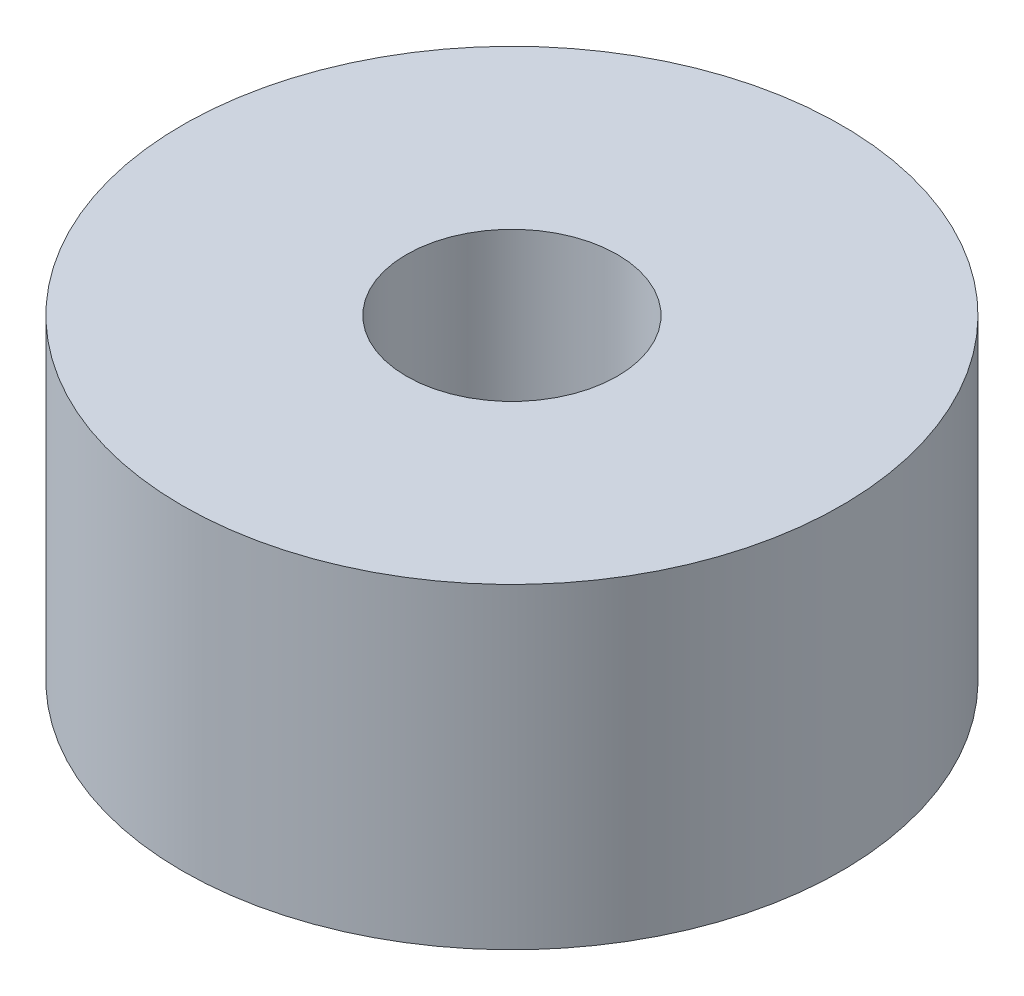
ISO-10303-21;
HEADER;
FILE_DESCRIPTION(('STEP AP214'),'2;1');
FILE_NAME('part.step','',(''),(''),'','','');
FILE_SCHEMA(('AUTOMOTIVE_DESIGN { 1 0 10303 214 1 1 1 1 }'));
ENDSEC;
DATA;
#1=APPLICATION_CONTEXT('core data for automotive mechanical design processes');
#2=APPLICATION_PROTOCOL_DEFINITION('international standard','automotive_design',2000,#1);
#3=PRODUCT_CONTEXT('',#1,'mechanical');
#4=PRODUCT('Part','Part','',(#3));
#5=PRODUCT_RELATED_PRODUCT_CATEGORY('part','',(#4));
#6=PRODUCT_DEFINITION_FORMATION('','',#4);
#7=PRODUCT_DEFINITION_CONTEXT('part definition',#1,'design');
#8=PRODUCT_DEFINITION('design','',#6,#7);
#9=PRODUCT_DEFINITION_SHAPE('','',#8);
#10=(LENGTH_UNIT() NAMED_UNIT(*) SI_UNIT(.MILLI.,.METRE.));
#11=(NAMED_UNIT(*) PLANE_ANGLE_UNIT() SI_UNIT($,.RADIAN.));
#12=(NAMED_UNIT(*) SI_UNIT($,.STERADIAN.) SOLID_ANGLE_UNIT());
#13=UNCERTAINTY_MEASURE_WITH_UNIT(LENGTH_MEASURE(1.E-05),#10,'distance_accuracy_value','');
#14=(GEOMETRIC_REPRESENTATION_CONTEXT(3) GLOBAL_UNCERTAINTY_ASSIGNED_CONTEXT((#13)) GLOBAL_UNIT_ASSIGNED_CONTEXT((#10,
#11,#12)) REPRESENTATION_CONTEXT('',''));
#15=CARTESIAN_POINT('',(0.,0.,0.));
#16=DIRECTION('',(0.,0.,1.));
#17=DIRECTION('',(1.,0.,0.));
#18=AXIS2_PLACEMENT_3D('',#15,#16,#17);
#19=CARTESIAN_POINT('',(0.,12.,0.));
#20=DIRECTION('',(0.,1.,0.));
#21=DIRECTION('',(0.,0.,1.));
#22=AXIS2_PLACEMENT_3D('',#19,#20,#21);
#23=PLANE('',#22);
#24=CARTESIAN_POINT('',(0.,12.,0.));
#25=DIRECTION('',(0.,1.,0.));
#26=DIRECTION('',(0.,0.,1.));
#27=AXIS2_PLACEMENT_3D('',#24,#25,#26);
#28=CIRCLE('',#27,12.5);
#29=CARTESIAN_POINT('',(0.,12.,12.5));
#30=VERTEX_POINT('',#29);
#31=EDGE_CURVE('E10',#30,#30,#28,.T.);
#32=ORIENTED_EDGE('',*,*,#31,.T.);
#33=EDGE_LOOP('',(#32));
#34=FACE_BOUND('',#33,.T.);
#35=CARTESIAN_POINT('',(0.,12.,0.));
#36=DIRECTION('',(0.,1.,0.));
#37=DIRECTION('',(0.,0.,1.));
#38=AXIS2_PLACEMENT_3D('',#35,#36,#37);
#39=CIRCLE('',#38,4.);
#40=CARTESIAN_POINT('',(0.,12.,4.));
#41=VERTEX_POINT('',#40);
#42=EDGE_CURVE('E42',#41,#41,#39,.T.);
#43=ORIENTED_EDGE('',*,*,#42,.F.);
#44=EDGE_LOOP('',(#43));
#45=FACE_BOUND('',#44,.T.);
#46=ADVANCED_FACE('F31',(#34,#45),#23,.T.);
#47=CARTESIAN_POINT('',(0.,0.,0.));
#48=DIRECTION('',(0.,1.,0.));
#49=DIRECTION('',(0.,0.,1.));
#50=AXIS2_PLACEMENT_3D('',#47,#48,#49);
#51=PLANE('',#50);
#52=CARTESIAN_POINT('',(0.,0.,0.));
#53=DIRECTION('',(0.,1.,0.));
#54=DIRECTION('',(0.,0.,1.));
#55=AXIS2_PLACEMENT_3D('',#52,#53,#54);
#56=CIRCLE('',#55,12.5);
#57=CARTESIAN_POINT('',(0.,0.,12.5));
#58=VERTEX_POINT('',#57);
#59=EDGE_CURVE('E35',#58,#58,#56,.T.);
#60=ORIENTED_EDGE('',*,*,#59,.F.);
#61=EDGE_LOOP('',(#60));
#62=FACE_BOUND('',#61,.T.);
#63=CARTESIAN_POINT('',(0.,0.,0.));
#64=DIRECTION('',(0.,1.,0.));
#65=DIRECTION('',(0.,0.,1.));
#66=AXIS2_PLACEMENT_3D('',#63,#64,#65);
#67=CIRCLE('',#66,4.);
#68=CARTESIAN_POINT('',(0.,0.,4.));
#69=VERTEX_POINT('',#68);
#70=EDGE_CURVE('E44',#69,#69,#67,.T.);
#71=ORIENTED_EDGE('',*,*,#70,.T.);
#72=EDGE_LOOP('',(#71));
#73=FACE_BOUND('',#72,.T.);
#74=ADVANCED_FACE('F54',(#62,#73),#51,.F.);
#75=CARTESIAN_POINT('',(0.,12.,0.));
#76=DIRECTION('',(0.,-1.,0.));
#77=DIRECTION('',(0.,0.,-1.));
#78=AXIS2_PLACEMENT_3D('',#75,#76,#77);
#79=CYLINDRICAL_SURFACE('',#78,12.5);
#80=ORIENTED_EDGE('',*,*,#31,.F.);
#81=EDGE_LOOP('',(#80));
#82=FACE_BOUND('',#81,.T.);
#83=ORIENTED_EDGE('',*,*,#59,.T.);
#84=EDGE_LOOP('',(#83));
#85=FACE_BOUND('',#84,.T.);
#86=ADVANCED_FACE('F33',(#82,#85),#79,.T.);
#87=CARTESIAN_POINT('',(0.,12.,0.));
#88=DIRECTION('',(0.,-1.,0.));
#89=DIRECTION('',(0.,0.,-1.));
#90=AXIS2_PLACEMENT_3D('',#87,#88,#89);
#91=CYLINDRICAL_SURFACE('',#90,4.);
#92=ORIENTED_EDGE('',*,*,#42,.T.);
#93=EDGE_LOOP('',(#92));
#94=FACE_BOUND('',#93,.T.);
#95=ORIENTED_EDGE('',*,*,#70,.F.);
#96=EDGE_LOOP('',(#95));
#97=FACE_BOUND('',#96,.T.);
#98=ADVANCED_FACE('F50',(#94,#97),#91,.F.);
#99=CLOSED_SHELL('',(#46,#74,#86,#98));
#100=MANIFOLD_SOLID_BREP('B2',#99);
#101=ADVANCED_BREP_SHAPE_REPRESENTATION('',(#18,#100),#14);
#102=SHAPE_DEFINITION_REPRESENTATION(#9,#101);
ENDSEC;
END-ISO-10303-21;
